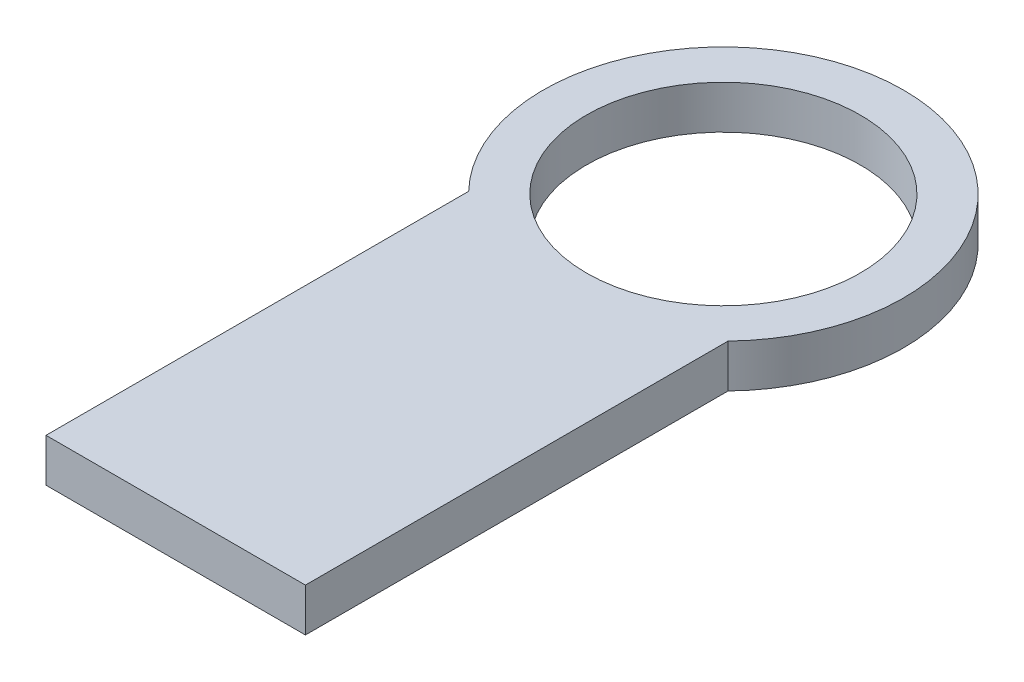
from build123d import *

# Parameters (mm, degrees)
SKETCH1_R      = 9.5
EXTRUDE1_DEPTH = 3


with BuildPart() as part:
    # Sketch1 → Extrude1 (new body)
    with BuildSketch(Plane(origin=(0, 0, 0), x_dir=(1, 0, 0), z_dir=(0, 1, 0))):
        with BuildLine():
            Line((9, 0), (9, 29.325324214))
            ThreePointArc((9, 29.325324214), (0, 50.5), (-9, 29.325324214))
            Line((-9, 29.325324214), (-9, 0))
            Line((-9, 0), (9, 0))
        make_face()
        with Locations(Location((0, 38, 0), (0, 0, 270))):
            Circle(SKETCH1_R, mode=Mode.SUBTRACT)
    extrude(amount=EXTRUDE1_DEPTH)


solid = part.part
